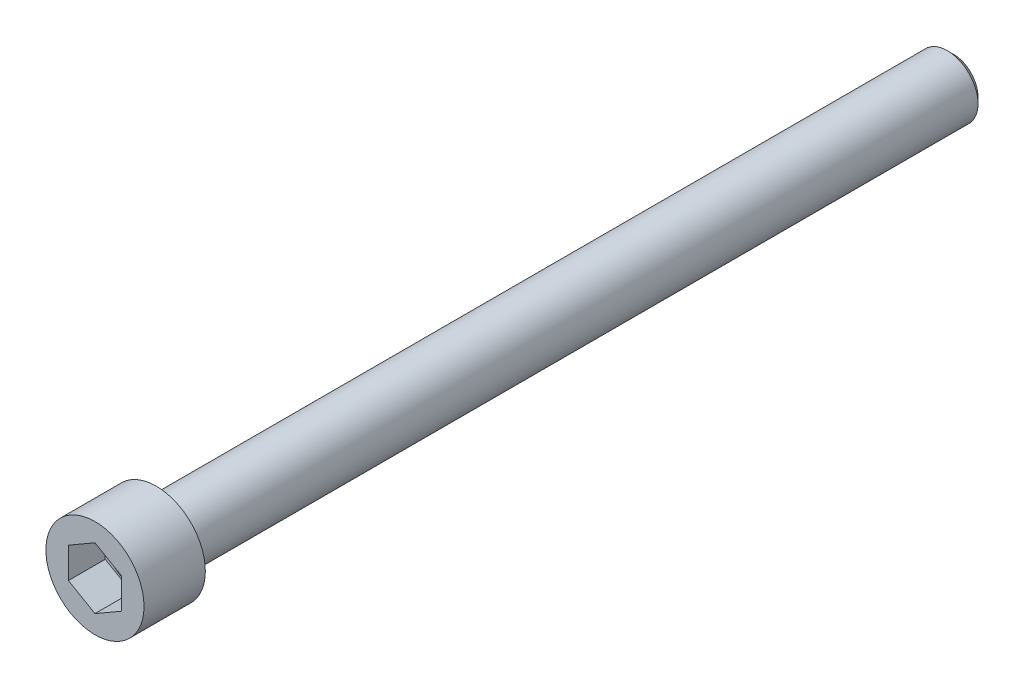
ISO-10303-21;
HEADER;
FILE_DESCRIPTION(('STEP AP214'),'2;1');
FILE_NAME('part.step','',(''),(''),'','','');
FILE_SCHEMA(('AUTOMOTIVE_DESIGN { 1 0 10303 214 1 1 1 1 }'));
ENDSEC;
DATA;
#1=APPLICATION_CONTEXT('core data for automotive mechanical design processes');
#2=APPLICATION_PROTOCOL_DEFINITION('international standard','automotive_design',2000,#1);
#3=PRODUCT_CONTEXT('',#1,'mechanical');
#4=PRODUCT('Part','Part','',(#3));
#5=PRODUCT_RELATED_PRODUCT_CATEGORY('part','',(#4));
#6=PRODUCT_DEFINITION_FORMATION('','',#4);
#7=PRODUCT_DEFINITION_CONTEXT('part definition',#1,'design');
#8=PRODUCT_DEFINITION('design','',#6,#7);
#9=PRODUCT_DEFINITION_SHAPE('','',#8);
#10=(LENGTH_UNIT() NAMED_UNIT(*) SI_UNIT(.MILLI.,.METRE.));
#11=(NAMED_UNIT(*) PLANE_ANGLE_UNIT() SI_UNIT($,.RADIAN.));
#12=(NAMED_UNIT(*) SI_UNIT($,.STERADIAN.) SOLID_ANGLE_UNIT());
#13=UNCERTAINTY_MEASURE_WITH_UNIT(LENGTH_MEASURE(1.E-05),#10,'distance_accuracy_value','');
#14=(GEOMETRIC_REPRESENTATION_CONTEXT(3) GLOBAL_UNCERTAINTY_ASSIGNED_CONTEXT((#13)) GLOBAL_UNIT_ASSIGNED_CONTEXT((#10,
#11,#12)) REPRESENTATION_CONTEXT('',''));
#15=CARTESIAN_POINT('',(0.,0.,0.));
#16=DIRECTION('',(0.,0.,1.));
#17=DIRECTION('',(1.,0.,0.));
#18=AXIS2_PLACEMENT_3D('',#15,#16,#17);
#19=CARTESIAN_POINT('',(0.,0.,-5.));
#20=DIRECTION('',(0.,0.,1.));
#21=DIRECTION('',(1.,0.,0.));
#22=AXIS2_PLACEMENT_3D('',#19,#20,#21);
#23=PLANE('',#22);
#24=CARTESIAN_POINT('',(0.,0.,-5.));
#25=DIRECTION('',(0.,0.,1.));
#26=DIRECTION('',(1.,0.,0.));
#27=AXIS2_PLACEMENT_3D('',#24,#25,#26);
#28=CIRCLE('',#27,4.);
#29=CARTESIAN_POINT('',(4.,0.,-5.));
#30=VERTEX_POINT('',#29);
#31=EDGE_CURVE('E147',#30,#30,#28,.T.);
#32=ORIENTED_EDGE('',*,*,#31,.F.);
#33=EDGE_LOOP('',(#32));
#34=FACE_BOUND('',#33,.T.);
#35=CARTESIAN_POINT('',(0.,0.,-5.));
#36=DIRECTION('',(0.,0.,1.));
#37=DIRECTION('',(1.,0.,0.));
#38=AXIS2_PLACEMENT_3D('',#35,#36,#37);
#39=CIRCLE('',#38,2.5);
#40=CARTESIAN_POINT('',(2.5,0.,-5.));
#41=VERTEX_POINT('',#40);
#42=EDGE_CURVE('E150',#41,#41,#39,.F.);
#43=ORIENTED_EDGE('',*,*,#42,.F.);
#44=EDGE_LOOP('',(#43));
#45=FACE_BOUND('',#44,.T.);
#46=ADVANCED_FACE('F28',(#34,#45),#23,.F.);
#47=CARTESIAN_POINT('',(0.,0.,-5.));
#48=DIRECTION('',(0.,0.,1.));
#49=DIRECTION('',(1.,0.,0.));
#50=AXIS2_PLACEMENT_3D('',#47,#48,#49);
#51=CYLINDRICAL_SURFACE('',#50,4.);
#52=ORIENTED_EDGE('',*,*,#31,.T.);
#53=EDGE_LOOP('',(#52));
#54=FACE_BOUND('',#53,.T.);
#55=CARTESIAN_POINT('',(0.,0.,0.));
#56=DIRECTION('',(0.,0.,1.));
#57=DIRECTION('',(1.,0.,0.));
#58=AXIS2_PLACEMENT_3D('',#55,#56,#57);
#59=CIRCLE('',#58,4.);
#60=CARTESIAN_POINT('',(4.,0.,0.));
#61=VERTEX_POINT('',#60);
#62=EDGE_CURVE('E135',#61,#61,#59,.T.);
#63=ORIENTED_EDGE('',*,*,#62,.F.);
#64=EDGE_LOOP('',(#63));
#65=FACE_BOUND('',#64,.T.);
#66=ADVANCED_FACE('F30',(#54,#65),#51,.T.);
#67=CARTESIAN_POINT('',(0.,0.,0.));
#68=DIRECTION('',(0.,0.,1.));
#69=DIRECTION('',(1.,0.,0.));
#70=AXIS2_PLACEMENT_3D('',#67,#68,#69);
#71=PLANE('',#70);
#72=DIRECTION('',(0.866025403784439,-0.5,0.));
#73=VECTOR('',#72,1.);
#74=CARTESIAN_POINT('',(-2.1650635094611,-1.25,0.));
#75=LINE('',#74,#73);
#76=CARTESIAN_POINT('',(-2.1650635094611,-1.25,0.));
#77=VERTEX_POINT('',#76);
#78=CARTESIAN_POINT('',(0.,-2.5,0.));
#79=VERTEX_POINT('',#78);
#80=EDGE_CURVE('E43',#77,#79,#75,.T.);
#81=ORIENTED_EDGE('',*,*,#80,.F.);
#82=DIRECTION('',(0.,-1.,0.));
#83=VECTOR('',#82,1.);
#84=CARTESIAN_POINT('',(-2.1650635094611,1.25,0.));
#85=LINE('',#84,#83);
#86=CARTESIAN_POINT('',(-2.1650635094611,1.25,0.));
#87=VERTEX_POINT('',#86);
#88=EDGE_CURVE('E113',#87,#77,#85,.T.);
#89=ORIENTED_EDGE('',*,*,#88,.F.);
#90=DIRECTION('',(-0.866025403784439,-0.5,0.));
#91=VECTOR('',#90,1.);
#92=CARTESIAN_POINT('',(0.,2.5,0.));
#93=LINE('',#92,#91);
#94=CARTESIAN_POINT('',(0.,2.5,0.));
#95=VERTEX_POINT('',#94);
#96=EDGE_CURVE('E110',#95,#87,#93,.T.);
#97=ORIENTED_EDGE('',*,*,#96,.F.);
#98=DIRECTION('',(-0.866025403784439,0.5,0.));
#99=VECTOR('',#98,1.);
#100=CARTESIAN_POINT('',(2.1650635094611,1.25,0.));
#101=LINE('',#100,#99);
#102=CARTESIAN_POINT('',(2.1650635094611,1.25,0.));
#103=VERTEX_POINT('',#102);
#104=EDGE_CURVE('E107',#103,#95,#101,.T.);
#105=ORIENTED_EDGE('',*,*,#104,.F.);
#106=DIRECTION('',(0.,1.,0.));
#107=VECTOR('',#106,1.);
#108=CARTESIAN_POINT('',(2.1650635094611,-1.25,0.));
#109=LINE('',#108,#107);
#110=CARTESIAN_POINT('',(2.1650635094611,-1.25,0.));
#111=VERTEX_POINT('',#110);
#112=EDGE_CURVE('E104',#111,#103,#109,.T.);
#113=ORIENTED_EDGE('',*,*,#112,.F.);
#114=DIRECTION('',(0.866025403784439,0.5,0.));
#115=VECTOR('',#114,1.);
#116=CARTESIAN_POINT('',(0.,-2.5,0.));
#117=LINE('',#116,#115);
#118=EDGE_CURVE('E95',#79,#111,#117,.T.);
#119=ORIENTED_EDGE('',*,*,#118,.F.);
#120=EDGE_LOOP('',(#81,#89,#97,#105,#113,#119));
#121=FACE_BOUND('',#120,.T.);
#122=ORIENTED_EDGE('',*,*,#62,.T.);
#123=EDGE_LOOP('',(#122));
#124=FACE_BOUND('',#123,.T.);
#125=ADVANCED_FACE('F174',(#121,#124),#71,.T.);
#126=CARTESIAN_POINT('',(0.,0.,-70.));
#127=DIRECTION('',(0.,0.,1.));
#128=DIRECTION('',(1.,0.,0.));
#129=AXIS2_PLACEMENT_3D('',#126,#127,#128);
#130=CYLINDRICAL_SURFACE('',#129,2.5);
#131=CARTESIAN_POINT('',(0.,0.,-69.5));
#132=DIRECTION('',(0.,0.,-1.));
#133=DIRECTION('',(-1.,0.,0.));
#134=AXIS2_PLACEMENT_3D('',#131,#132,#133);
#135=CIRCLE('',#134,2.5);
#136=CARTESIAN_POINT('',(-2.5,0.,-69.5));
#137=VERTEX_POINT('',#136);
#138=EDGE_CURVE('E11',#137,#137,#135,.F.);
#139=ORIENTED_EDGE('',*,*,#138,.T.);
#140=EDGE_LOOP('',(#139));
#141=FACE_BOUND('',#140,.T.);
#142=ORIENTED_EDGE('',*,*,#42,.T.);
#143=EDGE_LOOP('',(#142));
#144=FACE_BOUND('',#143,.T.);
#145=ADVANCED_FACE('F181',(#141,#144),#130,.T.);
#146=CARTESIAN_POINT('',(0.,0.,-70.));
#147=DIRECTION('',(0.,0.,-1.));
#148=DIRECTION('',(-1.,0.,0.));
#149=AXIS2_PLACEMENT_3D('',#146,#147,#148);
#150=PLANE('',#149);
#151=CARTESIAN_POINT('',(0.,0.,-70.));
#152=DIRECTION('',(0.,0.,-1.));
#153=DIRECTION('',(-1.,0.,0.));
#154=AXIS2_PLACEMENT_3D('',#151,#152,#153);
#155=CIRCLE('',#154,2.);
#156=CARTESIAN_POINT('',(-2.,0.,-70.));
#157=VERTEX_POINT('',#156);
#158=EDGE_CURVE('E36',#157,#157,#155,.T.);
#159=ORIENTED_EDGE('',*,*,#158,.T.);
#160=EDGE_LOOP('',(#159));
#161=FACE_BOUND('',#160,.T.);
#162=ADVANCED_FACE('F155',(#161),#150,.T.);
#163=CARTESIAN_POINT('',(-2.1650635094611,-1.25,-3.));
#164=DIRECTION('',(-0.5,-0.866025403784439,0.));
#165=DIRECTION('',(0.866025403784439,-0.5,0.));
#166=AXIS2_PLACEMENT_3D('',#163,#164,#165);
#167=PLANE('',#166);
#168=ORIENTED_EDGE('',*,*,#80,.T.);
#169=DIRECTION('',(0.,0.,1.));
#170=VECTOR('',#169,1.);
#171=CARTESIAN_POINT('',(0.,-2.5,-3.));
#172=LINE('',#171,#170);
#173=CARTESIAN_POINT('',(0.,-2.5,-3.));
#174=VERTEX_POINT('',#173);
#175=EDGE_CURVE('E133',#174,#79,#172,.T.);
#176=ORIENTED_EDGE('',*,*,#175,.F.);
#177=DIRECTION('',(0.866025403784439,-0.5,0.));
#178=VECTOR('',#177,1.);
#179=CARTESIAN_POINT('',(-2.1650635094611,-1.25,-3.));
#180=LINE('',#179,#178);
#181=CARTESIAN_POINT('',(-2.1650635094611,-1.25,-3.));
#182=VERTEX_POINT('',#181);
#183=EDGE_CURVE('E115',#182,#174,#180,.T.);
#184=ORIENTED_EDGE('',*,*,#183,.F.);
#185=DIRECTION('',(0.,0.,1.));
#186=VECTOR('',#185,1.);
#187=CARTESIAN_POINT('',(-2.1650635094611,-1.25,-3.));
#188=LINE('',#187,#186);
#189=EDGE_CURVE('E50',#182,#77,#188,.T.);
#190=ORIENTED_EDGE('',*,*,#189,.T.);
#191=EDGE_LOOP('',(#168,#176,#184,#190));
#192=FACE_BOUND('',#191,.T.);
#193=ADVANCED_FACE('F188',(#192),#167,.F.);
#194=CARTESIAN_POINT('',(-2.1650635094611,1.25,-3.));
#195=DIRECTION('',(-1.,0.,0.));
#196=DIRECTION('',(0.,-1.,0.));
#197=AXIS2_PLACEMENT_3D('',#194,#195,#196);
#198=PLANE('',#197);
#199=ORIENTED_EDGE('',*,*,#88,.T.);
#200=ORIENTED_EDGE('',*,*,#189,.F.);
#201=DIRECTION('',(0.,-1.,0.));
#202=VECTOR('',#201,1.);
#203=CARTESIAN_POINT('',(-2.1650635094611,1.25,-3.));
#204=LINE('',#203,#202);
#205=CARTESIAN_POINT('',(-2.1650635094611,1.25,-3.));
#206=VERTEX_POINT('',#205);
#207=EDGE_CURVE('E130',#206,#182,#204,.T.);
#208=ORIENTED_EDGE('',*,*,#207,.F.);
#209=DIRECTION('',(0.,0.,1.));
#210=VECTOR('',#209,1.);
#211=CARTESIAN_POINT('',(-2.1650635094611,1.25,-3.));
#212=LINE('',#211,#210);
#213=EDGE_CURVE('E136',#206,#87,#212,.T.);
#214=ORIENTED_EDGE('',*,*,#213,.T.);
#215=EDGE_LOOP('',(#199,#200,#208,#214));
#216=FACE_BOUND('',#215,.T.);
#217=ADVANCED_FACE('F191',(#216),#198,.F.);
#218=CARTESIAN_POINT('',(0.,2.5,-3.));
#219=DIRECTION('',(-0.5,0.866025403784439,0.));
#220=DIRECTION('',(-0.866025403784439,-0.5,0.));
#221=AXIS2_PLACEMENT_3D('',#218,#219,#220);
#222=PLANE('',#221);
#223=ORIENTED_EDGE('',*,*,#96,.T.);
#224=ORIENTED_EDGE('',*,*,#213,.F.);
#225=DIRECTION('',(-0.866025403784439,-0.5,0.));
#226=VECTOR('',#225,1.);
#227=CARTESIAN_POINT('',(0.,2.5,-3.));
#228=LINE('',#227,#226);
#229=CARTESIAN_POINT('',(0.,2.5,-3.));
#230=VERTEX_POINT('',#229);
#231=EDGE_CURVE('E127',#230,#206,#228,.T.);
#232=ORIENTED_EDGE('',*,*,#231,.F.);
#233=DIRECTION('',(0.,0.,1.));
#234=VECTOR('',#233,1.);
#235=CARTESIAN_POINT('',(0.,2.5,-3.));
#236=LINE('',#235,#234);
#237=EDGE_CURVE('E138',#230,#95,#236,.T.);
#238=ORIENTED_EDGE('',*,*,#237,.T.);
#239=EDGE_LOOP('',(#223,#224,#232,#238));
#240=FACE_BOUND('',#239,.T.);
#241=ADVANCED_FACE('F203',(#240),#222,.F.);
#242=CARTESIAN_POINT('',(2.1650635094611,1.25,-3.));
#243=DIRECTION('',(0.5,0.866025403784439,0.));
#244=DIRECTION('',(-0.866025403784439,0.5,0.));
#245=AXIS2_PLACEMENT_3D('',#242,#243,#244);
#246=PLANE('',#245);
#247=ORIENTED_EDGE('',*,*,#104,.T.);
#248=ORIENTED_EDGE('',*,*,#237,.F.);
#249=DIRECTION('',(-0.866025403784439,0.5,0.));
#250=VECTOR('',#249,1.);
#251=CARTESIAN_POINT('',(2.1650635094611,1.25,-3.));
#252=LINE('',#251,#250);
#253=CARTESIAN_POINT('',(2.1650635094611,1.25,-3.));
#254=VERTEX_POINT('',#253);
#255=EDGE_CURVE('E124',#254,#230,#252,.T.);
#256=ORIENTED_EDGE('',*,*,#255,.F.);
#257=DIRECTION('',(0.,0.,1.));
#258=VECTOR('',#257,1.);
#259=CARTESIAN_POINT('',(2.1650635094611,1.25,-3.));
#260=LINE('',#259,#258);
#261=EDGE_CURVE('E140',#254,#103,#260,.T.);
#262=ORIENTED_EDGE('',*,*,#261,.T.);
#263=EDGE_LOOP('',(#247,#248,#256,#262));
#264=FACE_BOUND('',#263,.T.);
#265=ADVANCED_FACE('F199',(#264),#246,.F.);
#266=CARTESIAN_POINT('',(2.1650635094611,-1.25,-3.));
#267=DIRECTION('',(1.,0.,0.));
#268=DIRECTION('',(0.,1.,0.));
#269=AXIS2_PLACEMENT_3D('',#266,#267,#268);
#270=PLANE('',#269);
#271=ORIENTED_EDGE('',*,*,#112,.T.);
#272=ORIENTED_EDGE('',*,*,#261,.F.);
#273=DIRECTION('',(0.,1.,0.));
#274=VECTOR('',#273,1.);
#275=CARTESIAN_POINT('',(2.1650635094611,-1.25,-3.));
#276=LINE('',#275,#274);
#277=CARTESIAN_POINT('',(2.1650635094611,-1.25,-3.));
#278=VERTEX_POINT('',#277);
#279=EDGE_CURVE('E121',#278,#254,#276,.T.);
#280=ORIENTED_EDGE('',*,*,#279,.F.);
#281=DIRECTION('',(0.,0.,1.));
#282=VECTOR('',#281,1.);
#283=CARTESIAN_POINT('',(2.1650635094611,-1.25,-3.));
#284=LINE('',#283,#282);
#285=EDGE_CURVE('E142',#278,#111,#284,.T.);
#286=ORIENTED_EDGE('',*,*,#285,.T.);
#287=EDGE_LOOP('',(#271,#272,#280,#286));
#288=FACE_BOUND('',#287,.T.);
#289=ADVANCED_FACE('F195',(#288),#270,.F.);
#290=CARTESIAN_POINT('',(0.,-2.5,-3.));
#291=DIRECTION('',(0.5,-0.866025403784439,0.));
#292=DIRECTION('',(0.866025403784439,0.5,0.));
#293=AXIS2_PLACEMENT_3D('',#290,#291,#292);
#294=PLANE('',#293);
#295=ORIENTED_EDGE('',*,*,#118,.T.);
#296=ORIENTED_EDGE('',*,*,#285,.F.);
#297=DIRECTION('',(0.866025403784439,0.5,0.));
#298=VECTOR('',#297,1.);
#299=CARTESIAN_POINT('',(0.,-2.5,-3.));
#300=LINE('',#299,#298);
#301=EDGE_CURVE('E118',#174,#278,#300,.T.);
#302=ORIENTED_EDGE('',*,*,#301,.F.);
#303=ORIENTED_EDGE('',*,*,#175,.T.);
#304=EDGE_LOOP('',(#295,#296,#302,#303));
#305=FACE_BOUND('',#304,.T.);
#306=ADVANCED_FACE('F192',(#305),#294,.F.);
#307=CARTESIAN_POINT('',(2.1650635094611,-3.75,-3.));
#308=DIRECTION('',(0.,0.,1.));
#309=DIRECTION('',(1.,0.,0.));
#310=AXIS2_PLACEMENT_3D('',#307,#308,#309);
#311=PLANE('',#310);
#312=CARTESIAN_POINT('',(0.,0.,-3.));
#313=DIRECTION('',(0.,0.,1.));
#314=DIRECTION('',(1.,0.,0.));
#315=AXIS2_PLACEMENT_3D('',#312,#313,#314);
#316=CIRCLE('',#315,2.);
#317=CARTESIAN_POINT('',(2.,0.,-3.));
#318=VERTEX_POINT('',#317);
#319=EDGE_CURVE('E223',#318,#318,#316,.T.);
#320=ORIENTED_EDGE('',*,*,#319,.F.);
#321=EDGE_LOOP('',(#320));
#322=FACE_BOUND('',#321,.T.);
#323=ORIENTED_EDGE('',*,*,#183,.T.);
#324=ORIENTED_EDGE('',*,*,#301,.T.);
#325=ORIENTED_EDGE('',*,*,#279,.T.);
#326=ORIENTED_EDGE('',*,*,#255,.T.);
#327=ORIENTED_EDGE('',*,*,#231,.T.);
#328=ORIENTED_EDGE('',*,*,#207,.T.);
#329=EDGE_LOOP('',(#323,#324,#325,#326,#327,#328));
#330=FACE_BOUND('',#329,.T.);
#331=ADVANCED_FACE('F87',(#322,#330),#311,.T.);
#332=CARTESIAN_POINT('',(0.,0.,-3.0002));
#333=DIRECTION('',(0.,0.,1.));
#334=DIRECTION('',(1.,0.,0.));
#335=AXIS2_PLACEMENT_3D('',#332,#333,#334);
#336=CONICAL_SURFACE('',#335,2.5999948,1.02974425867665);
#337=CARTESIAN_POINT('',(0.,0.,-4.56243448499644));
#338=VERTEX_POINT('',#337);
#339=VERTEX_LOOP('',#338);
#340=FACE_BOUND('',#339,.T.);
#341=CARTESIAN_POINT('',(0.,0.,-3.0002));
#342=DIRECTION('',(0.,0.,1.));
#343=DIRECTION('',(1.,0.,0.));
#344=AXIS2_PLACEMENT_3D('',#341,#342,#343);
#345=CIRCLE('',#344,2.5999948);
#346=CARTESIAN_POINT('',(2.5999948,0.,-3.0002));
#347=VERTEX_POINT('',#346);
#348=EDGE_CURVE('E91',#347,#347,#345,.T.);
#349=ORIENTED_EDGE('',*,*,#348,.T.);
#350=EDGE_LOOP('',(#349));
#351=FACE_BOUND('',#350,.T.);
#352=ADVANCED_FACE('F83',(#340,#351),#336,.F.);
#353=CARTESIAN_POINT('',(0.,0.,-3.));
#354=DIRECTION('',(0.,0.,1.));
#355=DIRECTION('',(1.,0.,0.));
#356=AXIS2_PLACEMENT_3D('',#353,#354,#355);
#357=CYLINDRICAL_SURFACE('',#356,2.5999948);
#358=ORIENTED_EDGE('',*,*,#348,.F.);
#359=EDGE_LOOP('',(#358));
#360=FACE_BOUND('',#359,.T.);
#361=CARTESIAN_POINT('',(0.,0.,-3.0001));
#362=DIRECTION('',(0.,0.,1.));
#363=DIRECTION('',(1.,0.,0.));
#364=AXIS2_PLACEMENT_3D('',#361,#362,#363);
#365=CIRCLE('',#364,2.59999480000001);
#366=CARTESIAN_POINT('',(2.59999480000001,0.,-3.0001));
#367=VERTEX_POINT('',#366);
#368=EDGE_CURVE('E93',#367,#367,#365,.T.);
#369=ORIENTED_EDGE('',*,*,#368,.T.);
#370=EDGE_LOOP('',(#369));
#371=FACE_BOUND('',#370,.T.);
#372=ADVANCED_FACE('F86',(#360,#371),#357,.F.);
#373=CARTESIAN_POINT('',(2.59999480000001,0.,-3.0001));
#374=DIRECTION('',(0.,0.,1.));
#375=DIRECTION('',(1.,0.,0.));
#376=AXIS2_PLACEMENT_3D('',#373,#374,#375);
#377=PLANE('',#376);
#378=ORIENTED_EDGE('',*,*,#368,.F.);
#379=EDGE_LOOP('',(#378));
#380=FACE_BOUND('',#379,.T.);
#381=CARTESIAN_POINT('',(0.,0.,-3.0001));
#382=DIRECTION('',(0.,0.,1.));
#383=DIRECTION('',(1.,0.,0.));
#384=AXIS2_PLACEMENT_3D('',#381,#382,#383);
#385=CIRCLE('',#384,1.99999700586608);
#386=CARTESIAN_POINT('',(1.99999700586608,0.,-3.0001));
#387=VERTEX_POINT('',#386);
#388=EDGE_CURVE('E98',#387,#387,#385,.T.);
#389=ORIENTED_EDGE('',*,*,#388,.T.);
#390=EDGE_LOOP('',(#389));
#391=FACE_BOUND('',#390,.T.);
#392=ADVANCED_FACE('F165',(#380,#391),#377,.F.);
#393=CARTESIAN_POINT('',(0.,0.,-3.));
#394=DIRECTION('',(0.,0.,1.));
#395=DIRECTION('',(1.,0.,0.));
#396=AXIS2_PLACEMENT_3D('',#393,#394,#395);
#397=CYLINDRICAL_SURFACE('',#396,1.99999850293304);
#398=ORIENTED_EDGE('',*,*,#388,.F.);
#399=EDGE_LOOP('',(#398));
#400=FACE_BOUND('',#399,.T.);
#401=ORIENTED_EDGE('',*,*,#319,.T.);
#402=EDGE_LOOP('',(#401));
#403=FACE_BOUND('',#402,.T.);
#404=ADVANCED_FACE('F159',(#400,#403),#397,.F.);
#405=CARTESIAN_POINT('',(0.,0.,-70.));
#406=DIRECTION('',(0.,0.,1.));
#407=DIRECTION('',(1.,0.,0.));
#408=AXIS2_PLACEMENT_3D('',#405,#406,#407);
#409=CONICAL_SURFACE('',#408,2.,0.785398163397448);
#410=ORIENTED_EDGE('',*,*,#138,.F.);
#411=EDGE_LOOP('',(#410));
#412=FACE_BOUND('',#411,.T.);
#413=ORIENTED_EDGE('',*,*,#158,.F.);
#414=EDGE_LOOP('',(#413));
#415=FACE_BOUND('',#414,.T.);
#416=ADVANCED_FACE('F157',(#412,#415),#409,.T.);
#417=CLOSED_SHELL('',(#46,#66,#125,#145,#162,#193,#217,#241,#265,#289,#306,#331,#352,#372,#392,
#404,#416));
#418=MANIFOLD_SOLID_BREP('B2',#417);
#419=ADVANCED_BREP_SHAPE_REPRESENTATION('',(#18,#418),#14);
#420=SHAPE_DEFINITION_REPRESENTATION(#9,#419);
ENDSEC;
END-ISO-10303-21;
